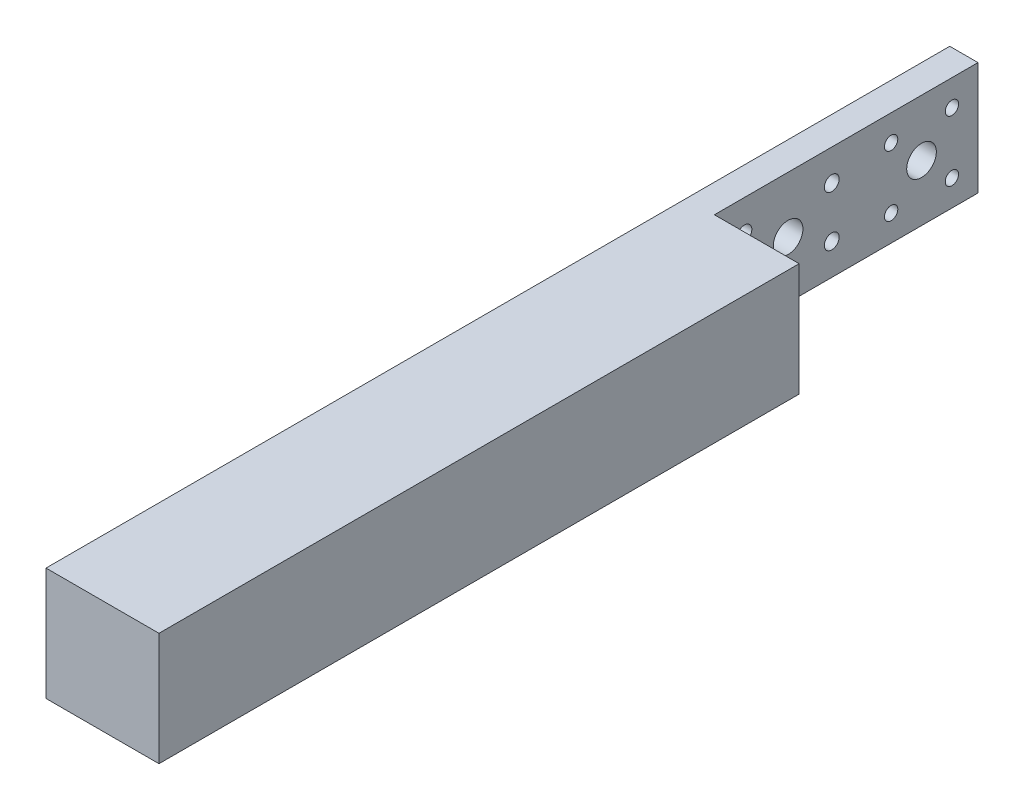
from build123d import *

# Parameters (mm, degrees)
SKETCH1_W           = 38.1
SKETCH1_H           = 38.1
BOSS_EXTRUDE1_DEPTH = 304.8
SKETCH2_R           = 5
CUT_EXTRUDE1_DEPTH  = 308.762168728
SKETCH4_R           = 2.5
CUT_EXTRUDE3_DEPTH  = 308.762168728
CIRPATTERN2_COUNT   = 6
SKETCH5_R           = 2.25
CUT_EXTRUDE4_DEPTH  = 308.762168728
CIRPATTERN3_COUNT   = 4
SKETCH6_W           = 88.9
SKETCH6_H           = 38.1
CUT_EXTRUDE5_DEPTH  = 28.575


with BuildPart() as part:
    # Sketch1 → Boss-Extrude1 (new body)
    with BuildSketch(Plane.XY):
        Rectangle(SKETCH1_W, SKETCH1_H)
    extrude(amount=BOSS_EXTRUDE1_DEPTH)

    # Sketch2 → Cut-Extrude1 (cut, through all)
    with BuildSketch(Plane(origin=(19.05, 0, 0), x_dir=(0, 0, -1), z_dir=(1, 0, 0))):
        with Locations(Location((-19.05, 0, 0), (0, 0, 90))):
            Circle(SKETCH2_R)
        with Locations(Location((-64.05, 0, 0), (0, 0, 90))):
            Circle(SKETCH2_R)
    extrude(amount=-CUT_EXTRUDE1_DEPTH, mode=Mode.SUBTRACT)

    # Sketch4 → Cut-Extrude3 (cut, through all)
    with BuildSketch(Plane(origin=(19.05, 0, 0), x_dir=(0, 0, -1), z_dir=(1, 0, 0))):
        with Locations(Location((-78.772431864, 8.5, 0), (0, 0, 90))):
            Circle(SKETCH4_R)
    cut_extrude3 = extrude(amount=-CUT_EXTRUDE3_DEPTH, mode=Mode.SUBTRACT)

    # CirPattern2: Cut-Extrude3 ×6 about axis, 2 skipped
    cirpattern2_axis = Axis((0, 0, 64.05), (1, 0, 0))
    add([cut_extrude3.rotate(cirpattern2_axis, i * 360 / CIRPATTERN2_COUNT) for i in range(1, CIRPATTERN2_COUNT) if i not in (2, 5)], mode=Mode.SUBTRACT)

    # Sketch5 → Cut-Extrude4 (cut, through all)
    with BuildSketch(Plane(origin=(19.05, 0, 0), x_dir=(0, 0, -1), z_dir=(1, 0, 0))):
        with Locations(Location((-29.303048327, 10.253048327, 0), (0, 0, 90))):
            Circle(SKETCH5_R)
    cut_extrude4 = extrude(amount=-CUT_EXTRUDE4_DEPTH, mode=Mode.SUBTRACT)

    # CirPattern3: Cut-Extrude4 ×4 about axis
    cirpattern3_axis = Axis((0, 0, 19.05), (1, 0, 0))
    for i in range(1, CIRPATTERN3_COUNT):
        add(cut_extrude4.rotate(cirpattern3_axis, i * 360 / CIRPATTERN3_COUNT), mode=Mode.SUBTRACT)

    # Sketch6 → Cut-Extrude5 (cut)
    with BuildSketch(Plane(origin=(19.05, 0, 0), x_dir=(0, 0, -1), z_dir=(1, 0, 0))):
        with Locations((-44.45, 0)):
            Rectangle(SKETCH6_W, SKETCH6_H)
    extrude(amount=-CUT_EXTRUDE5_DEPTH, mode=Mode.SUBTRACT)


solid = part.part
